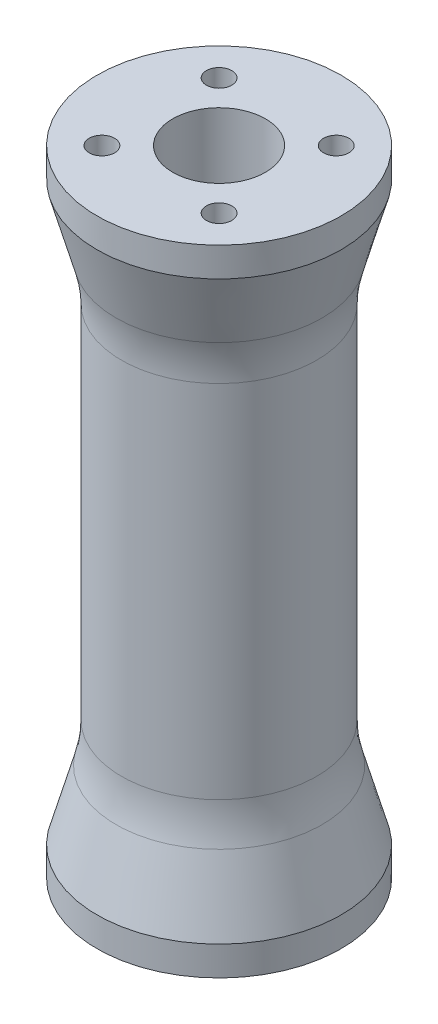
ISO-10303-21;
HEADER;
FILE_DESCRIPTION(('STEP AP214'),'2;1');
FILE_NAME('part.step','',(''),(''),'','','');
FILE_SCHEMA(('AUTOMOTIVE_DESIGN { 1 0 10303 214 1 1 1 1 }'));
ENDSEC;
DATA;
#1=APPLICATION_CONTEXT('core data for automotive mechanical design processes');
#2=APPLICATION_PROTOCOL_DEFINITION('international standard','automotive_design',2000,#1);
#3=PRODUCT_CONTEXT('',#1,'mechanical');
#4=PRODUCT('Part','Part','',(#3));
#5=PRODUCT_RELATED_PRODUCT_CATEGORY('part','',(#4));
#6=PRODUCT_DEFINITION_FORMATION('','',#4);
#7=PRODUCT_DEFINITION_CONTEXT('part definition',#1,'design');
#8=PRODUCT_DEFINITION('design','',#6,#7);
#9=PRODUCT_DEFINITION_SHAPE('','',#8);
#10=(LENGTH_UNIT() NAMED_UNIT(*) SI_UNIT(.MILLI.,.METRE.));
#11=(NAMED_UNIT(*) PLANE_ANGLE_UNIT() SI_UNIT($,.RADIAN.));
#12=(NAMED_UNIT(*) SI_UNIT($,.STERADIAN.) SOLID_ANGLE_UNIT());
#13=UNCERTAINTY_MEASURE_WITH_UNIT(LENGTH_MEASURE(1.E-05),#10,'distance_accuracy_value','');
#14=(GEOMETRIC_REPRESENTATION_CONTEXT(3) GLOBAL_UNCERTAINTY_ASSIGNED_CONTEXT((#13)) GLOBAL_UNIT_ASSIGNED_CONTEXT((#10,
#11,#12)) REPRESENTATION_CONTEXT('',''));
#15=CARTESIAN_POINT('',(0.,0.,0.));
#16=DIRECTION('',(0.,0.,1.));
#17=DIRECTION('',(1.,0.,0.));
#18=AXIS2_PLACEMENT_3D('',#15,#16,#17);
#19=CARTESIAN_POINT('',(0.,32.5,0.));
#20=DIRECTION('',(0.,-1.,0.));
#21=DIRECTION('',(0.,0.,-1.));
#22=AXIS2_PLACEMENT_3D('',#19,#20,#21);
#23=PLANE('',#22);
#24=CARTESIAN_POINT('',(0.,32.5,0.));
#25=DIRECTION('',(0.,1.,0.));
#26=DIRECTION('',(0.,0.,1.));
#27=AXIS2_PLACEMENT_3D('',#24,#25,#26);
#28=CIRCLE('',#27,4.75);
#29=CARTESIAN_POINT('',(0.,32.5,4.75));
#30=VERTEX_POINT('',#29);
#31=EDGE_CURVE('E170',#30,#30,#28,.T.);
#32=ORIENTED_EDGE('',*,*,#31,.F.);
#33=EDGE_LOOP('',(#32));
#34=FACE_BOUND('',#33,.T.);
#35=CARTESIAN_POINT('',(6.,32.5,-6.));
#36=DIRECTION('',(0.,1.,0.));
#37=DIRECTION('',(0.,0.,1.));
#38=AXIS2_PLACEMENT_3D('',#35,#36,#37);
#39=CIRCLE('',#38,1.3);
#40=CARTESIAN_POINT('',(6.,32.5,-4.7));
#41=VERTEX_POINT('',#40);
#42=EDGE_CURVE('E108',#41,#41,#39,.T.);
#43=ORIENTED_EDGE('',*,*,#42,.F.);
#44=EDGE_LOOP('',(#43));
#45=FACE_BOUND('',#44,.T.);
#46=CARTESIAN_POINT('',(-6.,32.5,6.));
#47=DIRECTION('',(0.,1.,0.));
#48=DIRECTION('',(0.,0.,1.));
#49=AXIS2_PLACEMENT_3D('',#46,#47,#48);
#50=CIRCLE('',#49,1.3);
#51=CARTESIAN_POINT('',(-6.,32.5,7.3));
#52=VERTEX_POINT('',#51);
#53=EDGE_CURVE('E116',#52,#52,#50,.T.);
#54=ORIENTED_EDGE('',*,*,#53,.F.);
#55=EDGE_LOOP('',(#54));
#56=FACE_BOUND('',#55,.T.);
#57=CARTESIAN_POINT('',(6.,32.5,6.));
#58=DIRECTION('',(0.,1.,0.));
#59=DIRECTION('',(0.,0.,1.));
#60=AXIS2_PLACEMENT_3D('',#57,#58,#59);
#61=CIRCLE('',#60,1.3);
#62=CARTESIAN_POINT('',(6.,32.5,7.3));
#63=VERTEX_POINT('',#62);
#64=EDGE_CURVE('E117',#63,#63,#61,.T.);
#65=ORIENTED_EDGE('',*,*,#64,.F.);
#66=EDGE_LOOP('',(#65));
#67=FACE_BOUND('',#66,.T.);
#68=CARTESIAN_POINT('',(-6.,32.5,-6.));
#69=DIRECTION('',(0.,1.,0.));
#70=DIRECTION('',(0.,0.,1.));
#71=AXIS2_PLACEMENT_3D('',#68,#69,#70);
#72=CIRCLE('',#71,1.3);
#73=CARTESIAN_POINT('',(-6.,32.5,-4.7));
#74=VERTEX_POINT('',#73);
#75=EDGE_CURVE('E104',#74,#74,#72,.T.);
#76=ORIENTED_EDGE('',*,*,#75,.F.);
#77=EDGE_LOOP('',(#76));
#78=FACE_BOUND('',#77,.T.);
#79=CARTESIAN_POINT('',(0.,32.5,0.));
#80=DIRECTION('',(0.,-1.,0.));
#81=DIRECTION('',(0.,0.,-1.));
#82=AXIS2_PLACEMENT_3D('',#79,#80,#81);
#83=CIRCLE('',#82,12.5);
#84=CARTESIAN_POINT('',(0.,32.5,-12.5));
#85=VERTEX_POINT('',#84);
#86=EDGE_CURVE('E81',#85,#85,#83,.T.);
#87=ORIENTED_EDGE('',*,*,#86,.F.);
#88=EDGE_LOOP('',(#87));
#89=FACE_BOUND('',#88,.T.);
#90=ADVANCED_FACE('F41',(#34,#45,#56,#67,#78,#89),#23,.F.);
#91=CARTESIAN_POINT('',(0.,-32.5,0.));
#92=DIRECTION('',(0.,-1.,0.));
#93=DIRECTION('',(0.,0.,-1.));
#94=AXIS2_PLACEMENT_3D('',#91,#92,#93);
#95=CYLINDRICAL_SURFACE('',#94,12.5);
#96=CARTESIAN_POINT('',(0.,29.5,0.));
#97=DIRECTION('',(0.,-1.,0.));
#98=DIRECTION('',(0.,0.,-1.));
#99=AXIS2_PLACEMENT_3D('',#96,#97,#98);
#100=CIRCLE('',#99,12.5);
#101=CARTESIAN_POINT('',(0.,29.5,-12.5));
#102=VERTEX_POINT('',#101);
#103=EDGE_CURVE('E91',#102,#102,#100,.T.);
#104=ORIENTED_EDGE('',*,*,#103,.F.);
#105=EDGE_LOOP('',(#104));
#106=FACE_BOUND('',#105,.T.);
#107=ORIENTED_EDGE('',*,*,#86,.T.);
#108=EDGE_LOOP('',(#107));
#109=FACE_BOUND('',#108,.T.);
#110=ADVANCED_FACE('F200',(#106,#109),#95,.T.);
#111=CARTESIAN_POINT('',(0.,29.5,0.));
#112=DIRECTION('',(0.,1.,0.));
#113=DIRECTION('',(0.,0.,1.));
#114=AXIS2_PLACEMENT_3D('',#111,#112,#113);
#115=CONICAL_SURFACE('',#114,12.5,0.270946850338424);
#116=CARTESIAN_POINT('',(0.,22.4700328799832,0.));
#117=DIRECTION('',(0.,1.,0.));
#118=DIRECTION('',(0.,0.,1.));
#119=AXIS2_PLACEMENT_3D('',#116,#117,#118);
#120=CIRCLE('',#119,10.5472313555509);
#121=CARTESIAN_POINT('',(0.,22.4700328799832,10.5472313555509));
#122=VERTEX_POINT('',#121);
#123=EDGE_CURVE('E65',#122,#122,#120,.T.);
#124=ORIENTED_EDGE('',*,*,#123,.T.);
#125=EDGE_LOOP('',(#124));
#126=FACE_BOUND('',#125,.T.);
#127=ORIENTED_EDGE('',*,*,#103,.T.);
#128=EDGE_LOOP('',(#127));
#129=FACE_BOUND('',#128,.T.);
#130=ADVANCED_FACE('F206',(#126,#129),#115,.T.);
#131=CARTESIAN_POINT('',(0.,-32.5,0.));
#132=DIRECTION('',(0.,-1.,0.));
#133=DIRECTION('',(0.,0.,-1.));
#134=AXIS2_PLACEMENT_3D('',#131,#132,#133);
#135=CYLINDRICAL_SURFACE('',#134,9.99999999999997);
#136=CARTESIAN_POINT('',(0.,-18.4553749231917,0.));
#137=DIRECTION('',(0.,-1.,0.));
#138=DIRECTION('',(0.,0.,-1.));
#139=AXIS2_PLACEMENT_3D('',#136,#137,#138);
#140=CIRCLE('',#139,9.99999999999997);
#141=CARTESIAN_POINT('',(0.,-18.4553749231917,-9.99999999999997));
#142=VERTEX_POINT('',#141);
#143=EDGE_CURVE('E69',#142,#142,#140,.F.);
#144=ORIENTED_EDGE('',*,*,#143,.T.);
#145=EDGE_LOOP('',(#144));
#146=FACE_BOUND('',#145,.T.);
#147=CARTESIAN_POINT('',(0.,18.4553749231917,0.));
#148=DIRECTION('',(0.,-1.,0.));
#149=DIRECTION('',(0.,0.,-1.));
#150=AXIS2_PLACEMENT_3D('',#147,#148,#149);
#151=CIRCLE('',#150,9.99999999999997);
#152=CARTESIAN_POINT('',(0.,18.4553749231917,-9.99999999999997));
#153=VERTEX_POINT('',#152);
#154=EDGE_CURVE('E73',#153,#153,#151,.T.);
#155=ORIENTED_EDGE('',*,*,#154,.T.);
#156=EDGE_LOOP('',(#155));
#157=FACE_BOUND('',#156,.T.);
#158=ADVANCED_FACE('F289',(#146,#157),#135,.T.);
#159=CARTESIAN_POINT('',(0.,-20.5,0.));
#160=DIRECTION('',(0.,-1.,0.));
#161=DIRECTION('',(0.,0.,-1.));
#162=AXIS2_PLACEMENT_3D('',#159,#160,#161);
#163=CONICAL_SURFACE('',#162,9.99999999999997,0.270946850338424);
#164=CARTESIAN_POINT('',(0.,-22.4700328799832,0.));
#165=DIRECTION('',(0.,-1.,0.));
#166=DIRECTION('',(0.,0.,-1.));
#167=AXIS2_PLACEMENT_3D('',#164,#165,#166);
#168=CIRCLE('',#167,10.5472313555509);
#169=CARTESIAN_POINT('',(0.,-22.4700328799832,-10.5472313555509));
#170=VERTEX_POINT('',#169);
#171=EDGE_CURVE('E77',#170,#170,#168,.T.);
#172=ORIENTED_EDGE('',*,*,#171,.T.);
#173=EDGE_LOOP('',(#172));
#174=FACE_BOUND('',#173,.T.);
#175=CARTESIAN_POINT('',(0.,-29.5,0.));
#176=DIRECTION('',(0.,-1.,0.));
#177=DIRECTION('',(0.,0.,-1.));
#178=AXIS2_PLACEMENT_3D('',#175,#176,#177);
#179=CIRCLE('',#178,12.5);
#180=CARTESIAN_POINT('',(0.,-29.5,-12.5));
#181=VERTEX_POINT('',#180);
#182=EDGE_CURVE('E95',#181,#181,#179,.T.);
#183=ORIENTED_EDGE('',*,*,#182,.F.);
#184=EDGE_LOOP('',(#183));
#185=FACE_BOUND('',#184,.T.);
#186=ADVANCED_FACE('F283',(#174,#185),#163,.T.);
#187=CARTESIAN_POINT('',(0.,-32.5,0.));
#188=DIRECTION('',(0.,-1.,0.));
#189=DIRECTION('',(0.,0.,-1.));
#190=AXIS2_PLACEMENT_3D('',#187,#188,#189);
#191=CYLINDRICAL_SURFACE('',#190,12.5);
#192=CARTESIAN_POINT('',(0.,-32.5,0.));
#193=DIRECTION('',(0.,-1.,0.));
#194=DIRECTION('',(0.,0.,-1.));
#195=AXIS2_PLACEMENT_3D('',#192,#193,#194);
#196=CIRCLE('',#195,12.5);
#197=CARTESIAN_POINT('',(0.,-32.5,-12.5));
#198=VERTEX_POINT('',#197);
#199=EDGE_CURVE('E99',#198,#198,#196,.T.);
#200=ORIENTED_EDGE('',*,*,#199,.F.);
#201=EDGE_LOOP('',(#200));
#202=FACE_BOUND('',#201,.T.);
#203=ORIENTED_EDGE('',*,*,#182,.T.);
#204=EDGE_LOOP('',(#203));
#205=FACE_BOUND('',#204,.T.);
#206=ADVANCED_FACE('F288',(#202,#205),#191,.T.);
#207=CARTESIAN_POINT('',(0.,-32.5,0.));
#208=DIRECTION('',(0.,1.,0.));
#209=DIRECTION('',(0.,0.,1.));
#210=AXIS2_PLACEMENT_3D('',#207,#208,#209);
#211=PLANE('',#210);
#212=CARTESIAN_POINT('',(0.,-32.5,0.));
#213=DIRECTION('',(0.,1.,0.));
#214=DIRECTION('',(0.,0.,1.));
#215=AXIS2_PLACEMENT_3D('',#212,#213,#214);
#216=CIRCLE('',#215,4.75);
#217=CARTESIAN_POINT('',(0.,-32.5,4.75));
#218=VERTEX_POINT('',#217);
#219=EDGE_CURVE('E87',#218,#218,#216,.T.);
#220=ORIENTED_EDGE('',*,*,#219,.T.);
#221=EDGE_LOOP('',(#220));
#222=FACE_BOUND('',#221,.T.);
#223=CARTESIAN_POINT('',(6.,-32.5,-6.));
#224=DIRECTION('',(0.,1.,0.));
#225=DIRECTION('',(0.,0.,1.));
#226=AXIS2_PLACEMENT_3D('',#223,#224,#225);
#227=CIRCLE('',#226,1.3);
#228=CARTESIAN_POINT('',(6.,-32.5,-4.7));
#229=VERTEX_POINT('',#228);
#230=EDGE_CURVE('E153',#229,#229,#227,.T.);
#231=ORIENTED_EDGE('',*,*,#230,.T.);
#232=EDGE_LOOP('',(#231));
#233=FACE_BOUND('',#232,.T.);
#234=CARTESIAN_POINT('',(-6.,-32.5,6.));
#235=DIRECTION('',(0.,1.,0.));
#236=DIRECTION('',(0.,0.,1.));
#237=AXIS2_PLACEMENT_3D('',#234,#235,#236);
#238=CIRCLE('',#237,1.3);
#239=CARTESIAN_POINT('',(-6.,-32.5,7.3));
#240=VERTEX_POINT('',#239);
#241=EDGE_CURVE('E144',#240,#240,#238,.T.);
#242=ORIENTED_EDGE('',*,*,#241,.T.);
#243=EDGE_LOOP('',(#242));
#244=FACE_BOUND('',#243,.T.);
#245=CARTESIAN_POINT('',(6.,-32.5,6.));
#246=DIRECTION('',(0.,1.,0.));
#247=DIRECTION('',(0.,0.,1.));
#248=AXIS2_PLACEMENT_3D('',#245,#246,#247);
#249=CIRCLE('',#248,1.3);
#250=CARTESIAN_POINT('',(6.,-32.5,7.3));
#251=VERTEX_POINT('',#250);
#252=EDGE_CURVE('E160',#251,#251,#249,.T.);
#253=ORIENTED_EDGE('',*,*,#252,.T.);
#254=EDGE_LOOP('',(#253));
#255=FACE_BOUND('',#254,.T.);
#256=CARTESIAN_POINT('',(-6.,-32.5,-6.));
#257=DIRECTION('',(0.,1.,0.));
#258=DIRECTION('',(0.,0.,1.));
#259=AXIS2_PLACEMENT_3D('',#256,#257,#258);
#260=CIRCLE('',#259,1.3);
#261=CARTESIAN_POINT('',(-6.,-32.5,-4.7));
#262=VERTEX_POINT('',#261);
#263=EDGE_CURVE('E136',#262,#262,#260,.T.);
#264=ORIENTED_EDGE('',*,*,#263,.T.);
#265=EDGE_LOOP('',(#264));
#266=FACE_BOUND('',#265,.T.);
#267=ORIENTED_EDGE('',*,*,#199,.T.);
#268=EDGE_LOOP('',(#267));
#269=FACE_BOUND('',#268,.T.);
#270=ADVANCED_FACE('F178',(#222,#233,#244,#255,#266,#269),#211,.F.);
#271=CARTESIAN_POINT('',(-6.,25.5,-6.));
#272=DIRECTION('',(0.,1.,0.));
#273=DIRECTION('',(0.,0.,1.));
#274=AXIS2_PLACEMENT_3D('',#271,#272,#273);
#275=CYLINDRICAL_SURFACE('',#274,1.3);
#276=CARTESIAN_POINT('',(-6.,25.5,-6.));
#277=DIRECTION('',(0.,1.,0.));
#278=DIRECTION('',(0.,0.,1.));
#279=AXIS2_PLACEMENT_3D('',#276,#277,#278);
#280=CIRCLE('',#279,1.3);
#281=CARTESIAN_POINT('',(-6.,25.5,-4.7));
#282=VERTEX_POINT('',#281);
#283=EDGE_CURVE('E103',#282,#282,#280,.T.);
#284=ORIENTED_EDGE('',*,*,#283,.F.);
#285=EDGE_LOOP('',(#284));
#286=FACE_BOUND('',#285,.T.);
#287=ORIENTED_EDGE('',*,*,#75,.T.);
#288=EDGE_LOOP('',(#287));
#289=FACE_BOUND('',#288,.T.);
#290=ADVANCED_FACE('F337',(#286,#289),#275,.F.);
#291=CARTESIAN_POINT('',(-6.,25.5,-6.));
#292=DIRECTION('',(0.,1.,0.));
#293=DIRECTION('',(0.,0.,1.));
#294=AXIS2_PLACEMENT_3D('',#291,#292,#293);
#295=PLANE('',#294);
#296=ORIENTED_EDGE('',*,*,#283,.T.);
#297=EDGE_LOOP('',(#296));
#298=FACE_BOUND('',#297,.T.);
#299=ADVANCED_FACE('F495',(#298),#295,.T.);
#300=CARTESIAN_POINT('',(6.,25.5,6.));
#301=DIRECTION('',(0.,1.,0.));
#302=DIRECTION('',(0.,0.,1.));
#303=AXIS2_PLACEMENT_3D('',#300,#301,#302);
#304=CYLINDRICAL_SURFACE('',#303,1.3);
#305=CARTESIAN_POINT('',(6.,25.5,6.));
#306=DIRECTION('',(0.,1.,0.));
#307=DIRECTION('',(0.,0.,1.));
#308=AXIS2_PLACEMENT_3D('',#305,#306,#307);
#309=CIRCLE('',#308,1.3);
#310=CARTESIAN_POINT('',(6.,25.5,7.3));
#311=VERTEX_POINT('',#310);
#312=EDGE_CURVE('E128',#311,#311,#309,.T.);
#313=ORIENTED_EDGE('',*,*,#312,.F.);
#314=EDGE_LOOP('',(#313));
#315=FACE_BOUND('',#314,.T.);
#316=ORIENTED_EDGE('',*,*,#64,.T.);
#317=EDGE_LOOP('',(#316));
#318=FACE_BOUND('',#317,.T.);
#319=ADVANCED_FACE('F484',(#315,#318),#304,.F.);
#320=CARTESIAN_POINT('',(6.,25.5,6.));
#321=DIRECTION('',(0.,1.,0.));
#322=DIRECTION('',(0.,0.,1.));
#323=AXIS2_PLACEMENT_3D('',#320,#321,#322);
#324=PLANE('',#323);
#325=ORIENTED_EDGE('',*,*,#312,.T.);
#326=EDGE_LOOP('',(#325));
#327=FACE_BOUND('',#326,.T.);
#328=ADVANCED_FACE('F473',(#327),#324,.T.);
#329=CARTESIAN_POINT('',(-6.,25.5,6.));
#330=DIRECTION('',(0.,1.,0.));
#331=DIRECTION('',(0.,0.,1.));
#332=AXIS2_PLACEMENT_3D('',#329,#330,#331);
#333=CYLINDRICAL_SURFACE('',#332,1.3);
#334=CARTESIAN_POINT('',(-6.,25.5,6.));
#335=DIRECTION('',(0.,1.,0.));
#336=DIRECTION('',(0.,0.,1.));
#337=AXIS2_PLACEMENT_3D('',#334,#335,#336);
#338=CIRCLE('',#337,1.3);
#339=CARTESIAN_POINT('',(-6.,25.5,7.3));
#340=VERTEX_POINT('',#339);
#341=EDGE_CURVE('E112',#340,#340,#338,.T.);
#342=ORIENTED_EDGE('',*,*,#341,.F.);
#343=EDGE_LOOP('',(#342));
#344=FACE_BOUND('',#343,.T.);
#345=ORIENTED_EDGE('',*,*,#53,.T.);
#346=EDGE_LOOP('',(#345));
#347=FACE_BOUND('',#346,.T.);
#348=ADVANCED_FACE('F462',(#344,#347),#333,.F.);
#349=CARTESIAN_POINT('',(-6.,25.5,6.));
#350=DIRECTION('',(0.,1.,0.));
#351=DIRECTION('',(0.,0.,1.));
#352=AXIS2_PLACEMENT_3D('',#349,#350,#351);
#353=PLANE('',#352);
#354=ORIENTED_EDGE('',*,*,#341,.T.);
#355=EDGE_LOOP('',(#354));
#356=FACE_BOUND('',#355,.T.);
#357=ADVANCED_FACE('F451',(#356),#353,.T.);
#358=CARTESIAN_POINT('',(6.,25.5,-6.));
#359=DIRECTION('',(0.,1.,0.));
#360=DIRECTION('',(0.,0.,1.));
#361=AXIS2_PLACEMENT_3D('',#358,#359,#360);
#362=CYLINDRICAL_SURFACE('',#361,1.3);
#363=CARTESIAN_POINT('',(6.,25.5,-6.));
#364=DIRECTION('',(0.,1.,0.));
#365=DIRECTION('',(0.,0.,1.));
#366=AXIS2_PLACEMENT_3D('',#363,#364,#365);
#367=CIRCLE('',#366,1.3);
#368=CARTESIAN_POINT('',(6.,25.5,-4.7));
#369=VERTEX_POINT('',#368);
#370=EDGE_CURVE('E121',#369,#369,#367,.T.);
#371=ORIENTED_EDGE('',*,*,#370,.F.);
#372=EDGE_LOOP('',(#371));
#373=FACE_BOUND('',#372,.T.);
#374=ORIENTED_EDGE('',*,*,#42,.T.);
#375=EDGE_LOOP('',(#374));
#376=FACE_BOUND('',#375,.T.);
#377=ADVANCED_FACE('F440',(#373,#376),#362,.F.);
#378=CARTESIAN_POINT('',(6.,25.5,-6.));
#379=DIRECTION('',(0.,1.,0.));
#380=DIRECTION('',(0.,0.,1.));
#381=AXIS2_PLACEMENT_3D('',#378,#379,#380);
#382=PLANE('',#381);
#383=ORIENTED_EDGE('',*,*,#370,.T.);
#384=EDGE_LOOP('',(#383));
#385=FACE_BOUND('',#384,.T.);
#386=ADVANCED_FACE('F429',(#385),#382,.T.);
#387=CARTESIAN_POINT('',(-6.,-25.5,-6.));
#388=DIRECTION('',(0.,-1.,0.));
#389=DIRECTION('',(0.,0.,-1.));
#390=AXIS2_PLACEMENT_3D('',#387,#388,#389);
#391=CYLINDRICAL_SURFACE('',#390,1.3);
#392=CARTESIAN_POINT('',(-6.,-25.5,-6.));
#393=DIRECTION('',(0.,1.,0.));
#394=DIRECTION('',(0.,0.,1.));
#395=AXIS2_PLACEMENT_3D('',#392,#393,#394);
#396=CIRCLE('',#395,1.3);
#397=CARTESIAN_POINT('',(-6.,-25.5,-4.7));
#398=VERTEX_POINT('',#397);
#399=EDGE_CURVE('E132',#398,#398,#396,.T.);
#400=ORIENTED_EDGE('',*,*,#399,.T.);
#401=EDGE_LOOP('',(#400));
#402=FACE_BOUND('',#401,.T.);
#403=ORIENTED_EDGE('',*,*,#263,.F.);
#404=EDGE_LOOP('',(#403));
#405=FACE_BOUND('',#404,.T.);
#406=ADVANCED_FACE('F418',(#402,#405),#391,.F.);
#407=CARTESIAN_POINT('',(-6.,-25.5,-6.));
#408=DIRECTION('',(0.,-1.,0.));
#409=DIRECTION('',(0.,0.,1.));
#410=AXIS2_PLACEMENT_3D('',#407,#408,#409);
#411=PLANE('',#410);
#412=ORIENTED_EDGE('',*,*,#399,.F.);
#413=EDGE_LOOP('',(#412));
#414=FACE_BOUND('',#413,.T.);
#415=ADVANCED_FACE('F407',(#414),#411,.T.);
#416=CARTESIAN_POINT('',(6.,-25.5,6.));
#417=DIRECTION('',(0.,-1.,0.));
#418=DIRECTION('',(0.,0.,-1.));
#419=AXIS2_PLACEMENT_3D('',#416,#417,#418);
#420=CYLINDRICAL_SURFACE('',#419,1.3);
#421=CARTESIAN_POINT('',(6.,-25.5,6.));
#422=DIRECTION('',(0.,1.,0.));
#423=DIRECTION('',(0.,0.,1.));
#424=AXIS2_PLACEMENT_3D('',#421,#422,#423);
#425=CIRCLE('',#424,1.3);
#426=CARTESIAN_POINT('',(6.,-25.5,7.3));
#427=VERTEX_POINT('',#426);
#428=EDGE_CURVE('E149',#427,#427,#425,.T.);
#429=ORIENTED_EDGE('',*,*,#428,.T.);
#430=EDGE_LOOP('',(#429));
#431=FACE_BOUND('',#430,.T.);
#432=ORIENTED_EDGE('',*,*,#252,.F.);
#433=EDGE_LOOP('',(#432));
#434=FACE_BOUND('',#433,.T.);
#435=ADVANCED_FACE('F397',(#431,#434),#420,.F.);
#436=CARTESIAN_POINT('',(6.,-25.5,6.));
#437=DIRECTION('',(0.,-1.,0.));
#438=DIRECTION('',(0.,0.,1.));
#439=AXIS2_PLACEMENT_3D('',#436,#437,#438);
#440=PLANE('',#439);
#441=ORIENTED_EDGE('',*,*,#428,.F.);
#442=EDGE_LOOP('',(#441));
#443=FACE_BOUND('',#442,.T.);
#444=ADVANCED_FACE('F386',(#443),#440,.T.);
#445=CARTESIAN_POINT('',(-6.,-25.5,6.));
#446=DIRECTION('',(0.,-1.,0.));
#447=DIRECTION('',(0.,0.,-1.));
#448=AXIS2_PLACEMENT_3D('',#445,#446,#447);
#449=CYLINDRICAL_SURFACE('',#448,1.3);
#450=CARTESIAN_POINT('',(-6.,-25.5,6.));
#451=DIRECTION('',(0.,1.,0.));
#452=DIRECTION('',(0.,0.,1.));
#453=AXIS2_PLACEMENT_3D('',#450,#451,#452);
#454=CIRCLE('',#453,1.3);
#455=CARTESIAN_POINT('',(-6.,-25.5,7.3));
#456=VERTEX_POINT('',#455);
#457=EDGE_CURVE('E148',#456,#456,#454,.T.);
#458=ORIENTED_EDGE('',*,*,#457,.T.);
#459=EDGE_LOOP('',(#458));
#460=FACE_BOUND('',#459,.T.);
#461=ORIENTED_EDGE('',*,*,#241,.F.);
#462=EDGE_LOOP('',(#461));
#463=FACE_BOUND('',#462,.T.);
#464=ADVANCED_FACE('F375',(#460,#463),#449,.F.);
#465=CARTESIAN_POINT('',(-6.,-25.5,6.));
#466=DIRECTION('',(0.,-1.,0.));
#467=DIRECTION('',(0.,0.,1.));
#468=AXIS2_PLACEMENT_3D('',#465,#466,#467);
#469=PLANE('',#468);
#470=ORIENTED_EDGE('',*,*,#457,.F.);
#471=EDGE_LOOP('',(#470));
#472=FACE_BOUND('',#471,.T.);
#473=ADVANCED_FACE('F364',(#472),#469,.T.);
#474=CARTESIAN_POINT('',(6.,-25.5,-6.));
#475=DIRECTION('',(0.,-1.,0.));
#476=DIRECTION('',(0.,0.,-1.));
#477=AXIS2_PLACEMENT_3D('',#474,#475,#476);
#478=CYLINDRICAL_SURFACE('',#477,1.3);
#479=CARTESIAN_POINT('',(6.,-25.5,-6.));
#480=DIRECTION('',(0.,1.,0.));
#481=DIRECTION('',(0.,0.,1.));
#482=AXIS2_PLACEMENT_3D('',#479,#480,#481);
#483=CIRCLE('',#482,1.3);
#484=CARTESIAN_POINT('',(6.,-25.5,-4.7));
#485=VERTEX_POINT('',#484);
#486=EDGE_CURVE('E140',#485,#485,#483,.T.);
#487=ORIENTED_EDGE('',*,*,#486,.T.);
#488=EDGE_LOOP('',(#487));
#489=FACE_BOUND('',#488,.T.);
#490=ORIENTED_EDGE('',*,*,#230,.F.);
#491=EDGE_LOOP('',(#490));
#492=FACE_BOUND('',#491,.T.);
#493=ADVANCED_FACE('F353',(#489,#492),#478,.F.);
#494=CARTESIAN_POINT('',(6.,-25.5,-6.));
#495=DIRECTION('',(0.,-1.,0.));
#496=DIRECTION('',(0.,0.,1.));
#497=AXIS2_PLACEMENT_3D('',#494,#495,#496);
#498=PLANE('',#497);
#499=ORIENTED_EDGE('',*,*,#486,.F.);
#500=EDGE_LOOP('',(#499));
#501=FACE_BOUND('',#500,.T.);
#502=ADVANCED_FACE('F327',(#501),#498,.T.);
#503=CARTESIAN_POINT('',(0.,-32.5,0.));
#504=DIRECTION('',(0.,1.,0.));
#505=DIRECTION('',(0.,0.,1.));
#506=AXIS2_PLACEMENT_3D('',#503,#504,#505);
#507=CYLINDRICAL_SURFACE('',#506,4.75);
#508=ORIENTED_EDGE('',*,*,#31,.T.);
#509=EDGE_LOOP('',(#508));
#510=FACE_BOUND('',#509,.T.);
#511=CARTESIAN_POINT('',(0.,24.95,0.));
#512=DIRECTION('',(0.,-1.,0.));
#513=DIRECTION('',(1.,0.,0.));
#514=AXIS2_PLACEMENT_3D('',#511,#512,#513);
#515=CIRCLE('',#514,4.75);
#516=CARTESIAN_POINT('',(4.75,24.95,0.));
#517=VERTEX_POINT('',#516);
#518=EDGE_CURVE('E82',#517,#517,#515,.F.);
#519=ORIENTED_EDGE('',*,*,#518,.F.);
#520=EDGE_LOOP('',(#519));
#521=FACE_BOUND('',#520,.T.);
#522=ADVANCED_FACE('F185',(#510,#521),#507,.F.);
#523=ORIENTED_EDGE('',*,*,#219,.F.);
#524=EDGE_LOOP('',(#523));
#525=FACE_BOUND('',#524,.T.);
#526=CARTESIAN_POINT('',(0.,-24.95,0.));
#527=DIRECTION('',(0.,1.,0.));
#528=DIRECTION('',(-1.,0.,0.));
#529=AXIS2_PLACEMENT_3D('',#526,#527,#528);
#530=CIRCLE('',#529,4.75);
#531=CARTESIAN_POINT('',(-4.74999999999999,-24.95,0.));
#532=VERTEX_POINT('',#531);
#533=EDGE_CURVE('E86',#532,#532,#530,.F.);
#534=ORIENTED_EDGE('',*,*,#533,.F.);
#535=EDGE_LOOP('',(#534));
#536=FACE_BOUND('',#535,.T.);
#537=ADVANCED_FACE('F181',(#525,#536),#507,.F.);
#538=CARTESIAN_POINT('',(0.,-20.7,0.));
#539=DIRECTION('',(0.,1.,0.));
#540=DIRECTION('',(-1.,0.,0.));
#541=AXIS2_PLACEMENT_3D('',#538,#539,#540);
#542=CONICAL_SURFACE('',#541,8.99999999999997,0.785398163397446);
#543=CARTESIAN_POINT('',(0.,-21.8715728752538,0.));
#544=DIRECTION('',(0.,1.,0.));
#545=DIRECTION('',(-1.,0.,0.));
#546=AXIS2_PLACEMENT_3D('',#543,#544,#545);
#547=CIRCLE('',#546,7.82842712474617);
#548=CARTESIAN_POINT('',(-7.82842712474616,-21.8715728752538,0.));
#549=VERTEX_POINT('',#548);
#550=EDGE_CURVE('E59',#549,#549,#547,.T.);
#551=ORIENTED_EDGE('',*,*,#550,.T.);
#552=EDGE_LOOP('',(#551));
#553=FACE_BOUND('',#552,.T.);
#554=ORIENTED_EDGE('',*,*,#533,.T.);
#555=EDGE_LOOP('',(#554));
#556=FACE_BOUND('',#555,.T.);
#557=ADVANCED_FACE('F184',(#553,#556),#542,.F.);
#558=CARTESIAN_POINT('',(0.,29.7,0.));
#559=DIRECTION('',(0.,1.,0.));
#560=DIRECTION('',(-1.,0.,0.));
#561=AXIS2_PLACEMENT_3D('',#558,#559,#560);
#562=CYLINDRICAL_SURFACE('',#561,8.99999999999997);
#563=CARTESIAN_POINT('',(0.,-19.0431457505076,0.));
#564=DIRECTION('',(0.,1.,0.));
#565=DIRECTION('',(-1.,0.,0.));
#566=AXIS2_PLACEMENT_3D('',#563,#564,#565);
#567=CIRCLE('',#566,8.99999999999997);
#568=CARTESIAN_POINT('',(-8.99999999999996,-19.0431457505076,0.));
#569=VERTEX_POINT('',#568);
#570=EDGE_CURVE('E49',#569,#569,#567,.F.);
#571=ORIENTED_EDGE('',*,*,#570,.T.);
#572=EDGE_LOOP('',(#571));
#573=FACE_BOUND('',#572,.T.);
#574=CARTESIAN_POINT('',(0.,19.0431457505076,0.));
#575=DIRECTION('',(0.,1.,0.));
#576=DIRECTION('',(-1.,0.,0.));
#577=AXIS2_PLACEMENT_3D('',#574,#575,#576);
#578=CIRCLE('',#577,8.99999999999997);
#579=CARTESIAN_POINT('',(-8.99999999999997,19.0431457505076,0.));
#580=VERTEX_POINT('',#579);
#581=EDGE_CURVE('E54',#580,#580,#578,.T.);
#582=ORIENTED_EDGE('',*,*,#581,.T.);
#583=EDGE_LOOP('',(#582));
#584=FACE_BOUND('',#583,.T.);
#585=ADVANCED_FACE('F190',(#573,#584),#562,.F.);
#586=CARTESIAN_POINT('',(0.,29.7,0.));
#587=DIRECTION('',(0.,-1.,0.));
#588=DIRECTION('',(1.,0.,0.));
#589=AXIS2_PLACEMENT_3D('',#586,#587,#588);
#590=CONICAL_SURFACE('',#589,0.,0.785398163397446);
#591=CARTESIAN_POINT('',(0.,21.8715728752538,0.));
#592=DIRECTION('',(0.,-1.,0.));
#593=DIRECTION('',(1.,0.,0.));
#594=AXIS2_PLACEMENT_3D('',#591,#592,#593);
#595=CIRCLE('',#594,7.82842712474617);
#596=CARTESIAN_POINT('',(7.82842712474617,21.8715728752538,0.));
#597=VERTEX_POINT('',#596);
#598=EDGE_CURVE('E10',#597,#597,#595,.T.);
#599=ORIENTED_EDGE('',*,*,#598,.T.);
#600=EDGE_LOOP('',(#599));
#601=FACE_BOUND('',#600,.T.);
#602=ORIENTED_EDGE('',*,*,#518,.T.);
#603=EDGE_LOOP('',(#602));
#604=FACE_BOUND('',#603,.T.);
#605=ADVANCED_FACE('F196',(#601,#604),#590,.F.);
#606=CARTESIAN_POINT('',(0.,-18.4553749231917,0.));
#607=DIRECTION('',(0.,-1.,0.));
#608=DIRECTION('',(0.,0.,-1.));
#609=AXIS2_PLACEMENT_3D('',#606,#607,#608);
#610=TOROIDAL_SURFACE('',#609,25.,15.);
#611=ORIENTED_EDGE('',*,*,#143,.F.);
#612=EDGE_LOOP('',(#611));
#613=FACE_BOUND('',#612,.T.);
#614=ORIENTED_EDGE('',*,*,#171,.F.);
#615=EDGE_LOOP('',(#614));
#616=FACE_BOUND('',#615,.T.);
#617=ADVANCED_FACE('F213',(#613,#616),#610,.F.);
#618=CARTESIAN_POINT('',(0.,18.4553749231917,0.));
#619=DIRECTION('',(0.,-1.,0.));
#620=DIRECTION('',(0.,0.,-1.));
#621=AXIS2_PLACEMENT_3D('',#618,#619,#620);
#622=TOROIDAL_SURFACE('',#621,25.,15.);
#623=ORIENTED_EDGE('',*,*,#123,.F.);
#624=EDGE_LOOP('',(#623));
#625=FACE_BOUND('',#624,.T.);
#626=ORIENTED_EDGE('',*,*,#154,.F.);
#627=EDGE_LOOP('',(#626));
#628=FACE_BOUND('',#627,.T.);
#629=ADVANCED_FACE('F216',(#625,#628),#622,.F.);
#630=CARTESIAN_POINT('',(0.,-19.0431457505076,0.));
#631=DIRECTION('',(0.,1.,0.));
#632=DIRECTION('',(-1.,0.,0.));
#633=AXIS2_PLACEMENT_3D('',#630,#631,#632);
#634=TOROIDAL_SURFACE('',#633,4.99999999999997,4.);
#635=ORIENTED_EDGE('',*,*,#570,.F.);
#636=EDGE_LOOP('',(#635));
#637=FACE_BOUND('',#636,.T.);
#638=ORIENTED_EDGE('',*,*,#550,.F.);
#639=EDGE_LOOP('',(#638));
#640=FACE_BOUND('',#639,.T.);
#641=ADVANCED_FACE('F219',(#637,#640),#634,.F.);
#642=CARTESIAN_POINT('',(0.,19.0431457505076,0.));
#643=DIRECTION('',(0.,1.,0.));
#644=DIRECTION('',(-1.,0.,0.));
#645=AXIS2_PLACEMENT_3D('',#642,#643,#644);
#646=TOROIDAL_SURFACE('',#645,4.99999999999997,4.);
#647=ORIENTED_EDGE('',*,*,#598,.F.);
#648=EDGE_LOOP('',(#647));
#649=FACE_BOUND('',#648,.T.);
#650=ORIENTED_EDGE('',*,*,#581,.F.);
#651=EDGE_LOOP('',(#650));
#652=FACE_BOUND('',#651,.T.);
#653=ADVANCED_FACE('F43',(#649,#652),#646,.F.);
#654=CLOSED_SHELL('',(#90,#110,#130,#158,#186,#206,#270,#290,#299,#319,#328,#348,#357,#377,#386,
#406,#415,#435,#444,#464,#473,#493,#502,#522,#537,#557,#585,#605,#617,#629,#641,#653));
#655=MANIFOLD_SOLID_BREP('B2',#654);
#656=ADVANCED_BREP_SHAPE_REPRESENTATION('',(#18,#655),#14);
#657=SHAPE_DEFINITION_REPRESENTATION(#9,#656);
ENDSEC;
END-ISO-10303-21;
